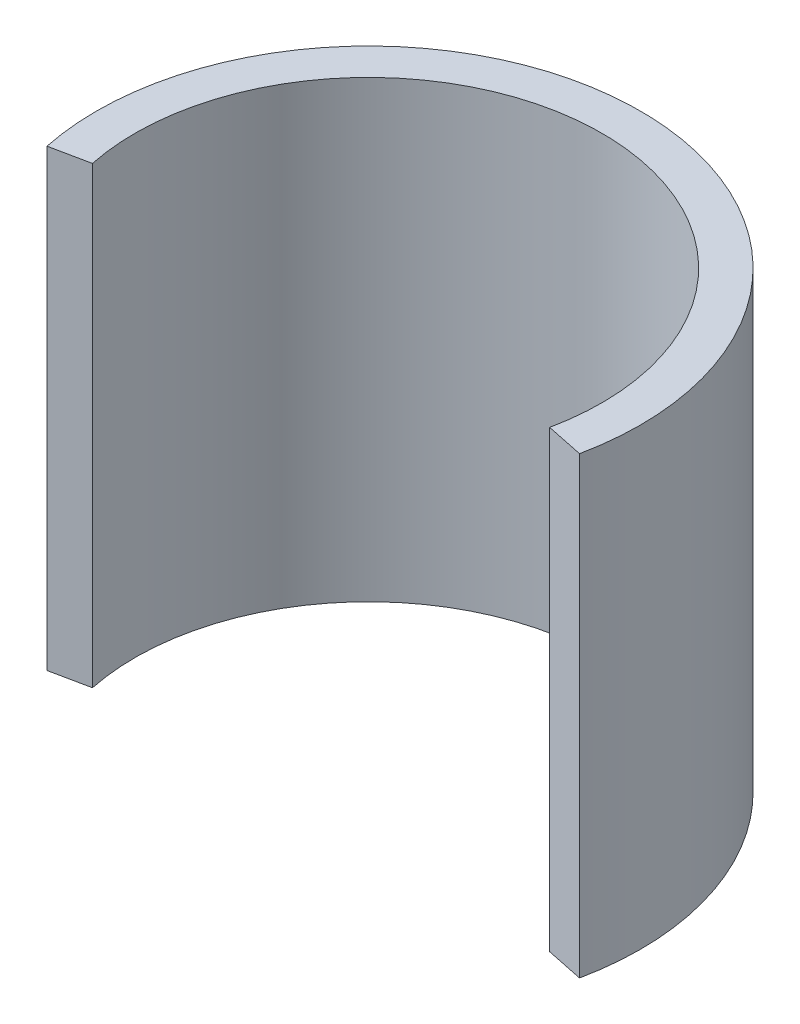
ISO-10303-21;
HEADER;
FILE_DESCRIPTION(('STEP AP214'),'2;1');
FILE_NAME('part.step','',(''),(''),'','','');
FILE_SCHEMA(('AUTOMOTIVE_DESIGN { 1 0 10303 214 1 1 1 1 }'));
ENDSEC;
DATA;
#1=APPLICATION_CONTEXT('core data for automotive mechanical design processes');
#2=APPLICATION_PROTOCOL_DEFINITION('international standard','automotive_design',2000,#1);
#3=PRODUCT_CONTEXT('',#1,'mechanical');
#4=PRODUCT('Part','Part','',(#3));
#5=PRODUCT_RELATED_PRODUCT_CATEGORY('part','',(#4));
#6=PRODUCT_DEFINITION_FORMATION('','',#4);
#7=PRODUCT_DEFINITION_CONTEXT('part definition',#1,'design');
#8=PRODUCT_DEFINITION('design','',#6,#7);
#9=PRODUCT_DEFINITION_SHAPE('','',#8);
#10=(LENGTH_UNIT() NAMED_UNIT(*) SI_UNIT(.MILLI.,.METRE.));
#11=(NAMED_UNIT(*) PLANE_ANGLE_UNIT() SI_UNIT($,.RADIAN.));
#12=(NAMED_UNIT(*) SI_UNIT($,.STERADIAN.) SOLID_ANGLE_UNIT());
#13=UNCERTAINTY_MEASURE_WITH_UNIT(LENGTH_MEASURE(1.E-05),#10,'distance_accuracy_value','');
#14=(GEOMETRIC_REPRESENTATION_CONTEXT(3) GLOBAL_UNCERTAINTY_ASSIGNED_CONTEXT((#13)) GLOBAL_UNIT_ASSIGNED_CONTEXT((#10,
#11,#12)) REPRESENTATION_CONTEXT('',''));
#15=CARTESIAN_POINT('',(0.,0.,0.));
#16=DIRECTION('',(0.,0.,1.));
#17=DIRECTION('',(1.,0.,0.));
#18=AXIS2_PLACEMENT_3D('',#15,#16,#17);
#19=CARTESIAN_POINT('',(34.5985981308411,59.,-7.17635449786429));
#20=DIRECTION('',(0.,-1.,0.));
#21=DIRECTION('',(0.,0.,-1.));
#22=AXIS2_PLACEMENT_3D('',#19,#20,#21);
#23=CYLINDRICAL_SURFACE('',#22,30.3350117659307);
#24=CARTESIAN_POINT('',(34.5985981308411,0.,-7.17635449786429));
#25=DIRECTION('',(0.,1.,0.));
#26=DIRECTION('',(1.,0.,0.));
#27=AXIS2_PLACEMENT_3D('',#24,#25,#26);
#28=CIRCLE('',#27,30.3350117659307);
#29=CARTESIAN_POINT('',(4.89579547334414,0.,-1.01547362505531));
#30=VERTEX_POINT('',#29);
#31=CARTESIAN_POINT('',(64.3014007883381,0.,-1.01547362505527));
#32=VERTEX_POINT('',#31);
#33=EDGE_CURVE('E84',#30,#32,#28,.F.);
#34=ORIENTED_EDGE('',*,*,#33,.T.);
#35=DIRECTION('',(0.,-1.,0.));
#36=VECTOR('',#35,1.);
#37=CARTESIAN_POINT('',(64.3014007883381,59.,-1.01547362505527));
#38=LINE('',#37,#36);
#39=CARTESIAN_POINT('',(64.3014007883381,59.,-1.01547362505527));
#40=VERTEX_POINT('',#39);
#41=EDGE_CURVE('E11',#40,#32,#38,.T.);
#42=ORIENTED_EDGE('',*,*,#41,.F.);
#43=CARTESIAN_POINT('',(34.5985981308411,59.,-7.17635449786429));
#44=DIRECTION('',(0.,1.,0.));
#45=DIRECTION('',(1.,0.,0.));
#46=AXIS2_PLACEMENT_3D('',#43,#44,#45);
#47=CIRCLE('',#46,30.3350117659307);
#48=CARTESIAN_POINT('',(4.89579547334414,59.,-1.01547362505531));
#49=VERTEX_POINT('',#48);
#50=EDGE_CURVE('E95',#49,#40,#47,.F.);
#51=ORIENTED_EDGE('',*,*,#50,.F.);
#52=DIRECTION('',(0.,-1.,0.));
#53=VECTOR('',#52,1.);
#54=CARTESIAN_POINT('',(4.89579547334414,59.,-1.01547362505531));
#55=LINE('',#54,#53);
#56=EDGE_CURVE('E47',#49,#30,#55,.T.);
#57=ORIENTED_EDGE('',*,*,#56,.T.);
#58=EDGE_LOOP('',(#34,#42,#51,#57));
#59=FACE_BOUND('',#58,.T.);
#60=ADVANCED_FACE('F33',(#59),#23,.F.);
#61=CARTESIAN_POINT('',(69.1971962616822,59.,0.));
#62=DIRECTION('',(-0.20309472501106,0.,0.97915909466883));
#63=DIRECTION('',(0.97915909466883,0.,0.20309472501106));
#64=AXIS2_PLACEMENT_3D('',#61,#62,#63);
#65=PLANE('',#64);
#66=DIRECTION('',(-0.97915909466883,0.,-0.20309472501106));
#67=VECTOR('',#66,1.);
#68=CARTESIAN_POINT('',(69.1971962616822,0.,0.));
#69=LINE('',#68,#67);
#70=CARTESIAN_POINT('',(69.1971962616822,0.,0.));
#71=VERTEX_POINT('',#70);
#72=EDGE_CURVE('E78',#71,#32,#69,.T.);
#73=ORIENTED_EDGE('',*,*,#72,.F.);
#74=DIRECTION('',(0.,-1.,0.));
#75=VECTOR('',#74,1.);
#76=CARTESIAN_POINT('',(69.1971962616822,59.,0.));
#77=LINE('',#76,#75);
#78=CARTESIAN_POINT('',(69.1971962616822,59.,0.));
#79=VERTEX_POINT('',#78);
#80=EDGE_CURVE('E40',#79,#71,#77,.T.);
#81=ORIENTED_EDGE('',*,*,#80,.F.);
#82=DIRECTION('',(-0.97915909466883,0.,-0.20309472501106));
#83=VECTOR('',#82,1.);
#84=CARTESIAN_POINT('',(69.1971962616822,59.,0.));
#85=LINE('',#84,#83);
#86=EDGE_CURVE('E81',#79,#40,#85,.T.);
#87=ORIENTED_EDGE('',*,*,#86,.T.);
#88=ORIENTED_EDGE('',*,*,#41,.T.);
#89=EDGE_LOOP('',(#73,#81,#87,#88));
#90=FACE_BOUND('',#89,.T.);
#91=ADVANCED_FACE('F76',(#90),#65,.T.);
#92=CARTESIAN_POINT('',(34.5985981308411,59.,-7.17635449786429));
#93=DIRECTION('',(0.,-1.,0.));
#94=DIRECTION('',(0.,0.,-1.));
#95=AXIS2_PLACEMENT_3D('',#92,#93,#94);
#96=CYLINDRICAL_SURFACE('',#95,35.3350117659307);
#97=CARTESIAN_POINT('',(34.5985981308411,0.,-7.17635449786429));
#98=DIRECTION('',(0.,-1.,0.));
#99=DIRECTION('',(0.,0.,-1.));
#100=AXIS2_PLACEMENT_3D('',#97,#98,#99);
#101=CIRCLE('',#100,35.3350117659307);
#102=CARTESIAN_POINT('',(0.,0.,0.));
#103=VERTEX_POINT('',#102);
#104=EDGE_CURVE('E89',#103,#71,#101,.T.);
#105=ORIENTED_EDGE('',*,*,#104,.F.);
#106=DIRECTION('',(0.,-1.,0.));
#107=VECTOR('',#106,1.);
#108=CARTESIAN_POINT('',(0.,59.,0.));
#109=LINE('',#108,#107);
#110=CARTESIAN_POINT('',(0.,59.,0.));
#111=VERTEX_POINT('',#110);
#112=EDGE_CURVE('E55',#111,#103,#109,.T.);
#113=ORIENTED_EDGE('',*,*,#112,.F.);
#114=CARTESIAN_POINT('',(34.5985981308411,59.,-7.17635449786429));
#115=DIRECTION('',(0.,-1.,0.));
#116=DIRECTION('',(0.,0.,-1.));
#117=AXIS2_PLACEMENT_3D('',#114,#115,#116);
#118=CIRCLE('',#117,35.3350117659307);
#119=EDGE_CURVE('E98',#111,#79,#118,.T.);
#120=ORIENTED_EDGE('',*,*,#119,.T.);
#121=ORIENTED_EDGE('',*,*,#80,.T.);
#122=EDGE_LOOP('',(#105,#113,#120,#121));
#123=FACE_BOUND('',#122,.T.);
#124=ADVANCED_FACE('F103',(#123),#96,.T.);
#125=CARTESIAN_POINT('',(4.89579547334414,59.,-1.01547362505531));
#126=DIRECTION('',(0.203094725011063,0.,0.979159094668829));
#127=DIRECTION('',(0.979159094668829,0.,-0.203094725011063));
#128=AXIS2_PLACEMENT_3D('',#125,#126,#127);
#129=PLANE('',#128);
#130=DIRECTION('',(-0.979159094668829,0.,0.203094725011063));
#131=VECTOR('',#130,1.);
#132=CARTESIAN_POINT('',(4.89579547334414,0.,-1.01547362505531));
#133=LINE('',#132,#131);
#134=EDGE_CURVE('E91',#30,#103,#133,.T.);
#135=ORIENTED_EDGE('',*,*,#134,.F.);
#136=ORIENTED_EDGE('',*,*,#56,.F.);
#137=DIRECTION('',(-0.979159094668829,0.,0.203094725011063));
#138=VECTOR('',#137,1.);
#139=CARTESIAN_POINT('',(4.89579547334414,59.,-1.01547362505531));
#140=LINE('',#139,#138);
#141=EDGE_CURVE('E100',#49,#111,#140,.T.);
#142=ORIENTED_EDGE('',*,*,#141,.T.);
#143=ORIENTED_EDGE('',*,*,#112,.T.);
#144=EDGE_LOOP('',(#135,#136,#142,#143));
#145=FACE_BOUND('',#144,.T.);
#146=ADVANCED_FACE('F107',(#145),#129,.T.);
#147=CARTESIAN_POINT('',(34.5985981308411,59.,-7.17635449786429));
#148=DIRECTION('',(0.,1.,0.));
#149=DIRECTION('',(0.,0.,1.));
#150=AXIS2_PLACEMENT_3D('',#147,#148,#149);
#151=PLANE('',#150);
#152=ORIENTED_EDGE('',*,*,#50,.T.);
#153=ORIENTED_EDGE('',*,*,#86,.F.);
#154=ORIENTED_EDGE('',*,*,#119,.F.);
#155=ORIENTED_EDGE('',*,*,#141,.F.);
#156=EDGE_LOOP('',(#152,#153,#154,#155));
#157=FACE_BOUND('',#156,.T.);
#158=ADVANCED_FACE('F105',(#157),#151,.T.);
#159=CARTESIAN_POINT('',(34.5985981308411,0.,-7.17635449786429));
#160=DIRECTION('',(0.,1.,0.));
#161=DIRECTION('',(0.,0.,1.));
#162=AXIS2_PLACEMENT_3D('',#159,#160,#161);
#163=PLANE('',#162);
#164=ORIENTED_EDGE('',*,*,#33,.F.);
#165=ORIENTED_EDGE('',*,*,#134,.T.);
#166=ORIENTED_EDGE('',*,*,#104,.T.);
#167=ORIENTED_EDGE('',*,*,#72,.T.);
#168=EDGE_LOOP('',(#164,#165,#166,#167));
#169=FACE_BOUND('',#168,.T.);
#170=ADVANCED_FACE('F88',(#169),#163,.F.);
#171=CLOSED_SHELL('',(#60,#91,#124,#146,#158,#170));
#172=MANIFOLD_SOLID_BREP('B2',#171);
#173=ADVANCED_BREP_SHAPE_REPRESENTATION('',(#18,#172),#14);
#174=SHAPE_DEFINITION_REPRESENTATION(#9,#173);
ENDSEC;
END-ISO-10303-21;
